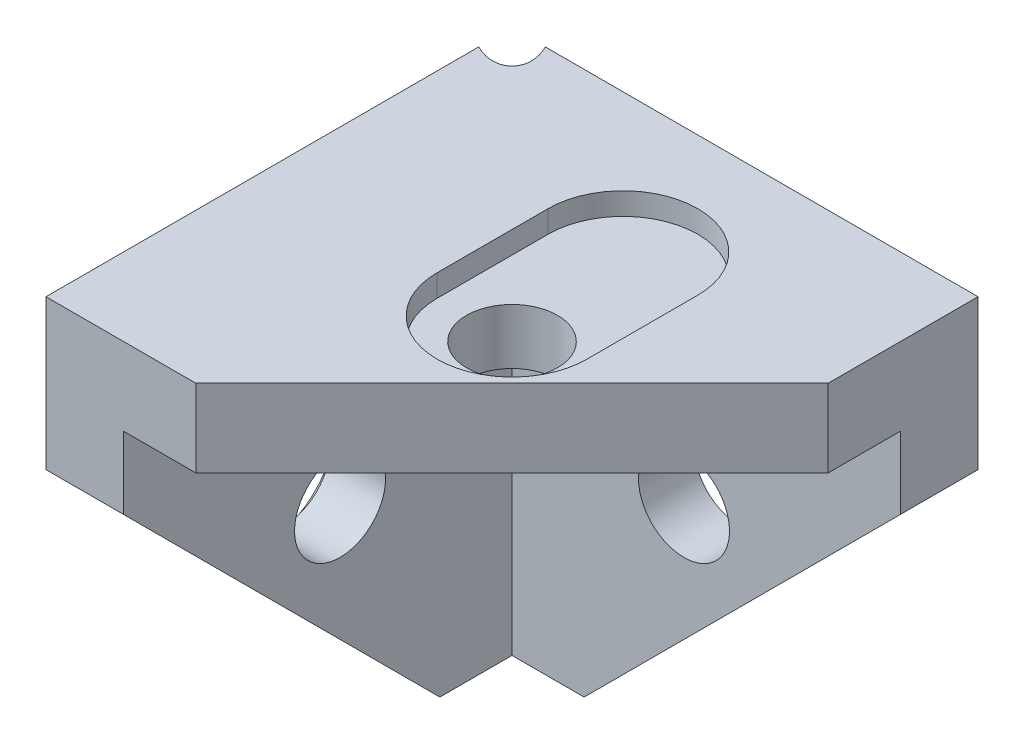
ISO-10303-21;
HEADER;
FILE_DESCRIPTION(('STEP AP214'),'2;1');
FILE_NAME('part.step','',(''),(''),'','','');
FILE_SCHEMA(('AUTOMOTIVE_DESIGN { 1 0 10303 214 1 1 1 1 }'));
ENDSEC;
DATA;
#1=APPLICATION_CONTEXT('core data for automotive mechanical design processes');
#2=APPLICATION_PROTOCOL_DEFINITION('international standard','automotive_design',2000,#1);
#3=PRODUCT_CONTEXT('',#1,'mechanical');
#4=PRODUCT('Part','Part','',(#3));
#5=PRODUCT_RELATED_PRODUCT_CATEGORY('part','',(#4));
#6=PRODUCT_DEFINITION_FORMATION('','',#4);
#7=PRODUCT_DEFINITION_CONTEXT('part definition',#1,'design');
#8=PRODUCT_DEFINITION('design','',#6,#7);
#9=PRODUCT_DEFINITION_SHAPE('','',#8);
#10=(LENGTH_UNIT() NAMED_UNIT(*) SI_UNIT(.MILLI.,.METRE.));
#11=(NAMED_UNIT(*) PLANE_ANGLE_UNIT() SI_UNIT($,.RADIAN.));
#12=(NAMED_UNIT(*) SI_UNIT($,.STERADIAN.) SOLID_ANGLE_UNIT());
#13=UNCERTAINTY_MEASURE_WITH_UNIT(LENGTH_MEASURE(1.E-05),#10,'distance_accuracy_value','');
#14=(GEOMETRIC_REPRESENTATION_CONTEXT(3) GLOBAL_UNCERTAINTY_ASSIGNED_CONTEXT((#13)) GLOBAL_UNIT_ASSIGNED_CONTEXT((#10,
#11,#12)) REPRESENTATION_CONTEXT('',''));
#15=CARTESIAN_POINT('',(0.,0.,0.));
#16=DIRECTION('',(0.,0.,1.));
#17=DIRECTION('',(1.,0.,0.));
#18=AXIS2_PLACEMENT_3D('',#15,#16,#17);
#19=CARTESIAN_POINT('',(2.,-17.5,22.5));
#20=DIRECTION('',(1.,0.,0.));
#21=DIRECTION('',(0.,0.,-1.));
#22=AXIS2_PLACEMENT_3D('',#19,#20,#21);
#23=PLANE('',#22);
#24=CARTESIAN_POINT('',(2.,-22.5,22.5));
#25=DIRECTION('',(-1.,0.,0.));
#26=DIRECTION('',(0.,0.,1.));
#27=AXIS2_PLACEMENT_3D('',#24,#25,#26);
#28=CIRCLE('',#27,4.1);
#29=CARTESIAN_POINT('',(2.,-22.5,26.6));
#30=VERTEX_POINT('',#29);
#31=EDGE_CURVE('E365',#30,#30,#28,.F.);
#32=ORIENTED_EDGE('',*,*,#31,.T.);
#33=EDGE_LOOP('',(#32));
#34=FACE_BOUND('',#33,.T.);
#35=DIRECTION('',(0.,1.,0.));
#36=VECTOR('',#35,1.);
#37=CARTESIAN_POINT('',(2.,-12.5,15.75));
#38=LINE('',#37,#36);
#39=CARTESIAN_POINT('',(2.,-12.5,15.75));
#40=VERTEX_POINT('',#39);
#41=CARTESIAN_POINT('',(2.,-22.5,15.75));
#42=VERTEX_POINT('',#41);
#43=EDGE_CURVE('E291',#40,#42,#38,.F.);
#44=ORIENTED_EDGE('',*,*,#43,.T.);
#45=CARTESIAN_POINT('',(2.,-22.5,22.5));
#46=DIRECTION('',(1.,0.,0.));
#47=DIRECTION('',(0.,0.,-1.));
#48=AXIS2_PLACEMENT_3D('',#45,#46,#47);
#49=CIRCLE('',#48,6.75);
#50=CARTESIAN_POINT('',(2.,-22.5,29.25));
#51=VERTEX_POINT('',#50);
#52=EDGE_CURVE('E288',#42,#51,#49,.F.);
#53=ORIENTED_EDGE('',*,*,#52,.T.);
#54=DIRECTION('',(0.,1.,0.));
#55=VECTOR('',#54,1.);
#56=CARTESIAN_POINT('',(2.,-22.5,29.25));
#57=LINE('',#56,#55);
#58=CARTESIAN_POINT('',(2.,-12.5,29.25));
#59=VERTEX_POINT('',#58);
#60=EDGE_CURVE('E294',#51,#59,#57,.T.);
#61=ORIENTED_EDGE('',*,*,#60,.T.);
#62=CARTESIAN_POINT('',(2.,-12.5,22.5));
#63=DIRECTION('',(1.,0.,0.));
#64=DIRECTION('',(0.,0.,-1.));
#65=AXIS2_PLACEMENT_3D('',#62,#63,#64);
#66=CIRCLE('',#65,6.75);
#67=EDGE_CURVE('E297',#59,#40,#66,.F.);
#68=ORIENTED_EDGE('',*,*,#67,.T.);
#69=EDGE_LOOP('',(#44,#53,#61,#68));
#70=FACE_BOUND('',#69,.T.);
#71=ADVANCED_FACE('F36',(#34,#70),#23,.F.);
#72=CARTESIAN_POINT('',(7.,-22.5,22.5));
#73=DIRECTION('',(-1.,0.,0.));
#74=DIRECTION('',(0.,0.,1.));
#75=AXIS2_PLACEMENT_3D('',#72,#73,#74);
#76=CYLINDRICAL_SURFACE('',#75,4.1);
#77=CARTESIAN_POINT('',(7.,-22.5,22.5));
#78=DIRECTION('',(-1.,0.,0.));
#79=DIRECTION('',(0.,0.,1.));
#80=AXIS2_PLACEMENT_3D('',#77,#78,#79);
#81=CIRCLE('',#80,4.1);
#82=CARTESIAN_POINT('',(7.,-22.5,26.6));
#83=VERTEX_POINT('',#82);
#84=EDGE_CURVE('E282',#83,#83,#81,.F.);
#85=ORIENTED_EDGE('',*,*,#84,.T.);
#86=EDGE_LOOP('',(#85));
#87=FACE_BOUND('',#86,.T.);
#88=ORIENTED_EDGE('',*,*,#31,.F.);
#89=EDGE_LOOP('',(#88));
#90=FACE_BOUND('',#89,.T.);
#91=ADVANCED_FACE('F541',(#87,#90),#76,.F.);
#92=CARTESIAN_POINT('',(22.5,-22.5,7.00000000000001));
#93=DIRECTION('',(0.,0.,-1.));
#94=DIRECTION('',(-1.,0.,0.));
#95=AXIS2_PLACEMENT_3D('',#92,#93,#94);
#96=CYLINDRICAL_SURFACE('',#95,4.1);
#97=CARTESIAN_POINT('',(22.5,-22.5,7.00000000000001));
#98=DIRECTION('',(0.,0.,-1.));
#99=DIRECTION('',(-1.,0.,0.));
#100=AXIS2_PLACEMENT_3D('',#97,#98,#99);
#101=CIRCLE('',#100,4.1);
#102=CARTESIAN_POINT('',(18.4,-22.5,7.00000000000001));
#103=VERTEX_POINT('',#102);
#104=EDGE_CURVE('E272',#103,#103,#101,.T.);
#105=ORIENTED_EDGE('',*,*,#104,.F.);
#106=EDGE_LOOP('',(#105));
#107=FACE_BOUND('',#106,.T.);
#108=CARTESIAN_POINT('',(22.5,-22.5,2.));
#109=DIRECTION('',(0.,0.,-1.));
#110=DIRECTION('',(-1.,0.,0.));
#111=AXIS2_PLACEMENT_3D('',#108,#109,#110);
#112=CIRCLE('',#111,4.1);
#113=CARTESIAN_POINT('',(18.4,-22.5,2.));
#114=VERTEX_POINT('',#113);
#115=EDGE_CURVE('E363',#114,#114,#112,.T.);
#116=ORIENTED_EDGE('',*,*,#115,.T.);
#117=EDGE_LOOP('',(#116));
#118=FACE_BOUND('',#117,.T.);
#119=ADVANCED_FACE('F537',(#107,#118),#96,.F.);
#120=CARTESIAN_POINT('',(17.4999797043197,-22.4882973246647,2.));
#121=DIRECTION('',(0.,0.,1.));
#122=DIRECTION('',(1.,0.,0.));
#123=AXIS2_PLACEMENT_3D('',#120,#121,#122);
#124=PLANE('',#123);
#125=ORIENTED_EDGE('',*,*,#115,.F.);
#126=EDGE_LOOP('',(#125));
#127=FACE_BOUND('',#126,.T.);
#128=CARTESIAN_POINT('',(12.499959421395,-22.4765946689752,2.));
#129=DIRECTION('',(0.,0.,1.));
#130=DIRECTION('',(1.,0.,0.));
#131=AXIS2_PLACEMENT_3D('',#128,#129,#130);
#132=CIRCLE('',#131,6.75);
#133=CARTESIAN_POINT('',(12.484160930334,-29.2265761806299,2.));
#134=VERTEX_POINT('',#133);
#135=CARTESIAN_POINT('',(12.5157579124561,-15.7266131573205,2.));
#136=VERTEX_POINT('',#135);
#137=EDGE_CURVE('E256',#134,#136,#132,.F.);
#138=ORIENTED_EDGE('',*,*,#137,.T.);
#139=DIRECTION('',(-0.999997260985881,0.002340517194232,0.));
#140=VECTOR('',#139,1.);
#141=CARTESIAN_POINT('',(12.5157579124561,-15.7266131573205,2.));
#142=LINE('',#141,#140);
#143=CARTESIAN_POINT('',(22.5157984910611,-15.7500184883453,2.));
#144=VERTEX_POINT('',#143);
#145=EDGE_CURVE('E252',#136,#144,#142,.F.);
#146=ORIENTED_EDGE('',*,*,#145,.T.);
#147=CARTESIAN_POINT('',(22.5,-22.5,2.));
#148=DIRECTION('',(0.,0.,1.));
#149=DIRECTION('',(1.,0.,0.));
#150=AXIS2_PLACEMENT_3D('',#147,#148,#149);
#151=CIRCLE('',#150,6.75);
#152=CARTESIAN_POINT('',(22.4842015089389,-29.2499815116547,2.));
#153=VERTEX_POINT('',#152);
#154=EDGE_CURVE('E248',#144,#153,#151,.F.);
#155=ORIENTED_EDGE('',*,*,#154,.T.);
#156=DIRECTION('',(0.999997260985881,-0.002340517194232,0.));
#157=VECTOR('',#156,1.);
#158=CARTESIAN_POINT('',(22.4842015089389,-29.2499815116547,2.));
#159=LINE('',#158,#157);
#160=EDGE_CURVE('E245',#153,#134,#159,.F.);
#161=ORIENTED_EDGE('',*,*,#160,.T.);
#162=EDGE_LOOP('',(#138,#146,#155,#161));
#163=FACE_BOUND('',#162,.T.);
#164=ADVANCED_FACE('F534',(#127,#163),#124,.F.);
#165=CARTESIAN_POINT('',(22.5,-7.,22.5));
#166=DIRECTION('',(0.,1.,0.));
#167=DIRECTION('',(0.,0.,1.));
#168=AXIS2_PLACEMENT_3D('',#165,#166,#167);
#169=CYLINDRICAL_SURFACE('',#168,4.1);
#170=CARTESIAN_POINT('',(22.5,-6.99999999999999,22.5));
#171=DIRECTION('',(0.,1.,0.));
#172=DIRECTION('',(0.,0.,1.));
#173=AXIS2_PLACEMENT_3D('',#170,#171,#172);
#174=CIRCLE('',#173,4.1);
#175=CARTESIAN_POINT('',(22.5,-6.99999999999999,26.6));
#176=VERTEX_POINT('',#175);
#177=EDGE_CURVE('E277',#176,#176,#174,.F.);
#178=ORIENTED_EDGE('',*,*,#177,.T.);
#179=EDGE_LOOP('',(#178));
#180=FACE_BOUND('',#179,.T.);
#181=CARTESIAN_POINT('',(22.5,-1.99999999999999,22.5));
#182=DIRECTION('',(0.,1.,0.));
#183=DIRECTION('',(0.,0.,1.));
#184=AXIS2_PLACEMENT_3D('',#181,#182,#183);
#185=CIRCLE('',#184,4.1);
#186=CARTESIAN_POINT('',(22.5,-1.99999999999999,26.6));
#187=VERTEX_POINT('',#186);
#188=EDGE_CURVE('E300',#187,#187,#185,.F.);
#189=ORIENTED_EDGE('',*,*,#188,.F.);
#190=EDGE_LOOP('',(#189));
#191=FACE_BOUND('',#190,.T.);
#192=ADVANCED_FACE('F38',(#180,#191),#169,.F.);
#193=CARTESIAN_POINT('',(0.,-12.5,22.5));
#194=DIRECTION('',(1.,0.,0.));
#195=DIRECTION('',(0.,0.,-1.));
#196=AXIS2_PLACEMENT_3D('',#193,#194,#195);
#197=CYLINDRICAL_SURFACE('',#196,6.75);
#198=DIRECTION('',(1.,0.,0.));
#199=VECTOR('',#198,1.);
#200=CARTESIAN_POINT('',(0.,-12.5,29.25));
#201=LINE('',#200,#199);
#202=CARTESIAN_POINT('',(0.,-12.5,29.25));
#203=VERTEX_POINT('',#202);
#204=EDGE_CURVE('E295',#59,#203,#201,.F.);
#205=ORIENTED_EDGE('',*,*,#204,.T.);
#206=CARTESIAN_POINT('',(0.,-12.5,22.5));
#207=DIRECTION('',(1.,0.,0.));
#208=DIRECTION('',(0.,0.,-1.));
#209=AXIS2_PLACEMENT_3D('',#206,#207,#208);
#210=CIRCLE('',#209,6.75);
#211=CARTESIAN_POINT('',(0.,-12.5,15.75));
#212=VERTEX_POINT('',#211);
#213=EDGE_CURVE('E231',#212,#203,#210,.T.);
#214=ORIENTED_EDGE('',*,*,#213,.F.);
#215=DIRECTION('',(-1.,0.,0.));
#216=VECTOR('',#215,1.);
#217=CARTESIAN_POINT('',(0.,-12.5,15.75));
#218=LINE('',#217,#216);
#219=EDGE_CURVE('E287',#212,#40,#218,.F.);
#220=ORIENTED_EDGE('',*,*,#219,.T.);
#221=ORIENTED_EDGE('',*,*,#67,.F.);
#222=EDGE_LOOP('',(#205,#214,#220,#221));
#223=FACE_BOUND('',#222,.T.);
#224=ADVANCED_FACE('F529',(#223),#197,.F.);
#225=CARTESIAN_POINT('',(0.,-22.5,29.25));
#226=DIRECTION('',(0.,0.,1.));
#227=DIRECTION('',(1.,0.,0.));
#228=AXIS2_PLACEMENT_3D('',#225,#226,#227);
#229=PLANE('',#228);
#230=DIRECTION('',(1.,0.,0.));
#231=VECTOR('',#230,1.);
#232=CARTESIAN_POINT('',(0.,-22.5,29.25));
#233=LINE('',#232,#231);
#234=CARTESIAN_POINT('',(0.,-22.5,29.25));
#235=VERTEX_POINT('',#234);
#236=EDGE_CURVE('E292',#51,#235,#233,.F.);
#237=ORIENTED_EDGE('',*,*,#236,.T.);
#238=DIRECTION('',(0.,1.,0.));
#239=VECTOR('',#238,1.);
#240=CARTESIAN_POINT('',(0.,-42.,29.25));
#241=LINE('',#240,#239);
#242=EDGE_CURVE('E228',#203,#235,#241,.F.);
#243=ORIENTED_EDGE('',*,*,#242,.F.);
#244=ORIENTED_EDGE('',*,*,#204,.F.);
#245=ORIENTED_EDGE('',*,*,#60,.F.);
#246=EDGE_LOOP('',(#237,#243,#244,#245));
#247=FACE_BOUND('',#246,.T.);
#248=ADVANCED_FACE('F525',(#247),#229,.F.);
#249=CARTESIAN_POINT('',(0.,-22.5,22.5));
#250=DIRECTION('',(1.,0.,0.));
#251=DIRECTION('',(0.,0.,-1.));
#252=AXIS2_PLACEMENT_3D('',#249,#250,#251);
#253=CYLINDRICAL_SURFACE('',#252,6.75);
#254=DIRECTION('',(-1.,0.,0.));
#255=VECTOR('',#254,1.);
#256=CARTESIAN_POINT('',(0.,-22.5,15.75));
#257=LINE('',#256,#255);
#258=CARTESIAN_POINT('',(0.,-22.5,15.75));
#259=VERTEX_POINT('',#258);
#260=EDGE_CURVE('E285',#42,#259,#257,.T.);
#261=ORIENTED_EDGE('',*,*,#260,.T.);
#262=CARTESIAN_POINT('',(0.,-22.5,22.5));
#263=DIRECTION('',(1.,0.,0.));
#264=DIRECTION('',(0.,0.,-1.));
#265=AXIS2_PLACEMENT_3D('',#262,#263,#264);
#266=CIRCLE('',#265,6.75);
#267=EDGE_CURVE('E223',#235,#259,#266,.T.);
#268=ORIENTED_EDGE('',*,*,#267,.F.);
#269=ORIENTED_EDGE('',*,*,#236,.F.);
#270=ORIENTED_EDGE('',*,*,#52,.F.);
#271=EDGE_LOOP('',(#261,#268,#269,#270));
#272=FACE_BOUND('',#271,.T.);
#273=ADVANCED_FACE('F521',(#272),#253,.F.);
#274=CARTESIAN_POINT('',(0.,-12.5,15.75));
#275=DIRECTION('',(0.,0.,-1.));
#276=DIRECTION('',(-1.,0.,0.));
#277=AXIS2_PLACEMENT_3D('',#274,#275,#276);
#278=PLANE('',#277);
#279=ORIENTED_EDGE('',*,*,#219,.F.);
#280=DIRECTION('',(0.,1.,0.));
#281=VECTOR('',#280,1.);
#282=CARTESIAN_POINT('',(0.,-42.,15.75));
#283=LINE('',#282,#281);
#284=EDGE_CURVE('E218',#259,#212,#283,.T.);
#285=ORIENTED_EDGE('',*,*,#284,.F.);
#286=ORIENTED_EDGE('',*,*,#260,.F.);
#287=ORIENTED_EDGE('',*,*,#43,.F.);
#288=EDGE_LOOP('',(#279,#285,#286,#287));
#289=FACE_BOUND('',#288,.T.);
#290=ADVANCED_FACE('F517',(#289),#278,.F.);
#291=CARTESIAN_POINT('',(7.,-6.99999999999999,42.));
#292=DIRECTION('',(-1.,0.,0.));
#293=DIRECTION('',(0.,0.,1.));
#294=AXIS2_PLACEMENT_3D('',#291,#292,#293);
#295=PLANE('',#294);
#296=ORIENTED_EDGE('',*,*,#84,.F.);
#297=EDGE_LOOP('',(#296));
#298=FACE_BOUND('',#297,.T.);
#299=DIRECTION('',(0.,1.,0.));
#300=VECTOR('',#299,1.);
#301=CARTESIAN_POINT('',(7.,-17.6568542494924,42.));
#302=LINE('',#301,#300);
#303=CARTESIAN_POINT('',(7.,-13.5,42.));
#304=VERTEX_POINT('',#303);
#305=CARTESIAN_POINT('',(7.,-6.99999999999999,42.));
#306=VERTEX_POINT('',#305);
#307=EDGE_CURVE('E217',#304,#306,#302,.T.);
#308=ORIENTED_EDGE('',*,*,#307,.F.);
#309=DIRECTION('',(0.,-0.707106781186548,-0.707106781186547));
#310=VECTOR('',#309,1.);
#311=CARTESIAN_POINT('',(7.,-10.25,45.25));
#312=LINE('',#311,#310);
#313=CARTESIAN_POINT('',(7.,-42.,13.5));
#314=VERTEX_POINT('',#313);
#315=EDGE_CURVE('E50',#304,#314,#312,.T.);
#316=ORIENTED_EDGE('',*,*,#315,.T.);
#317=DIRECTION('',(0.,0.,-1.));
#318=VECTOR('',#317,1.);
#319=CARTESIAN_POINT('',(7.00000000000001,-42.,0.));
#320=LINE('',#319,#318);
#321=CARTESIAN_POINT('',(7.,-42.,7.00000000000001));
#322=VERTEX_POINT('',#321);
#323=EDGE_CURVE('E304',#322,#314,#320,.F.);
#324=ORIENTED_EDGE('',*,*,#323,.F.);
#325=DIRECTION('',(0.,1.,0.));
#326=VECTOR('',#325,1.);
#327=CARTESIAN_POINT('',(7.,-28.9551446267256,7.00000000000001));
#328=LINE('',#327,#326);
#329=CARTESIAN_POINT('',(7.,-10.0006249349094,7.00000000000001));
#330=VERTEX_POINT('',#329);
#331=EDGE_CURVE('E273',#330,#322,#328,.F.);
#332=ORIENTED_EDGE('',*,*,#331,.F.);
#333=CARTESIAN_POINT('',(7.,-7.,7.));
#334=DIRECTION('',(-1.,0.,0.));
#335=DIRECTION('',(0.,0.707106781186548,-0.707106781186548));
#336=AXIS2_PLACEMENT_3D('',#333,#334,#335);
#337=ELLIPSE('',#336,4.24352447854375,2.45);
#338=CARTESIAN_POINT('',(7.,-6.99999999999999,10.0006249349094));
#339=VERTEX_POINT('',#338);
#340=EDGE_CURVE('E345',#330,#339,#337,.T.);
#341=ORIENTED_EDGE('',*,*,#340,.T.);
#342=DIRECTION('',(0.,0.,1.));
#343=VECTOR('',#342,1.);
#344=CARTESIAN_POINT('',(7.,-6.99999999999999,42.));
#345=LINE('',#344,#343);
#346=EDGE_CURVE('E279',#339,#306,#345,.T.);
#347=ORIENTED_EDGE('',*,*,#346,.T.);
#348=EDGE_LOOP('',(#308,#316,#324,#332,#341,#347));
#349=FACE_BOUND('',#348,.T.);
#350=ADVANCED_FACE('F513',(#298,#349),#295,.F.);
#351=CARTESIAN_POINT('',(57.2448854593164,-6.99999999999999,42.));
#352=DIRECTION('',(0.,1.,0.));
#353=DIRECTION('',(0.,0.,1.));
#354=AXIS2_PLACEMENT_3D('',#351,#352,#353);
#355=PLANE('',#354);
#356=ORIENTED_EDGE('',*,*,#177,.F.);
#357=EDGE_LOOP('',(#356));
#358=FACE_BOUND('',#357,.T.);
#359=DIRECTION('',(0.,0.,-1.));
#360=VECTOR('',#359,1.);
#361=CARTESIAN_POINT('',(42.,-6.99999999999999,0.));
#362=LINE('',#361,#360);
#363=CARTESIAN_POINT('',(42.,-6.99999999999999,13.5));
#364=VERTEX_POINT('',#363);
#365=CARTESIAN_POINT('',(42.,-6.99999999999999,7.00000000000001));
#366=VERTEX_POINT('',#365);
#367=EDGE_CURVE('E269',#364,#366,#362,.T.);
#368=ORIENTED_EDGE('',*,*,#367,.F.);
#369=DIRECTION('',(-0.707106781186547,0.,0.707106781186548));
#370=VECTOR('',#369,1.);
#371=CARTESIAN_POINT('',(35.3724427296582,-6.99999999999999,20.1275572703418));
#372=LINE('',#371,#370);
#373=CARTESIAN_POINT('',(13.5,-6.99999999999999,42.));
#374=VERTEX_POINT('',#373);
#375=EDGE_CURVE('E367',#364,#374,#372,.T.);
#376=ORIENTED_EDGE('',*,*,#375,.T.);
#377=DIRECTION('',(1.,0.,0.));
#378=VECTOR('',#377,1.);
#379=CARTESIAN_POINT('',(17.6568542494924,-6.99999999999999,42.));
#380=LINE('',#379,#378);
#381=EDGE_CURVE('E220',#306,#374,#380,.T.);
#382=ORIENTED_EDGE('',*,*,#381,.F.);
#383=ORIENTED_EDGE('',*,*,#346,.F.);
#384=CARTESIAN_POINT('',(6.99999999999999,-6.99999999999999,6.99999999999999));
#385=DIRECTION('',(0.,1.,0.));
#386=DIRECTION('',(-0.707106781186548,0.,-0.707106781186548));
#387=AXIS2_PLACEMENT_3D('',#384,#385,#386);
#388=ELLIPSE('',#387,4.24352447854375,2.45);
#389=CARTESIAN_POINT('',(10.0006249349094,-6.99999999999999,7.00000000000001));
#390=VERTEX_POINT('',#389);
#391=EDGE_CURVE('E342',#339,#390,#388,.T.);
#392=ORIENTED_EDGE('',*,*,#391,.T.);
#393=DIRECTION('',(1.,0.,0.));
#394=VECTOR('',#393,1.);
#395=CARTESIAN_POINT('',(32.1224427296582,-6.99999999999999,7.00000000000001));
#396=LINE('',#395,#394);
#397=EDGE_CURVE('E270',#366,#390,#396,.F.);
#398=ORIENTED_EDGE('',*,*,#397,.F.);
#399=EDGE_LOOP('',(#368,#376,#382,#383,#392,#398));
#400=FACE_BOUND('',#399,.T.);
#401=ADVANCED_FACE('F437',(#358,#400),#355,.F.);
#402=CARTESIAN_POINT('',(32.1224427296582,-28.9551446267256,7.00000000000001));
#403=DIRECTION('',(0.,0.,1.));
#404=DIRECTION('',(1.,0.,0.));
#405=AXIS2_PLACEMENT_3D('',#402,#403,#404);
#406=PLANE('',#405);
#407=DIRECTION('',(-0.707106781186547,-0.707106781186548,0.));
#408=VECTOR('',#407,1.);
#409=CARTESIAN_POINT('',(29.3336490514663,-26.1663509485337,7.00000000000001));
#410=LINE('',#409,#408);
#411=CARTESIAN_POINT('',(42.,-13.5,7.00000000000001));
#412=VERTEX_POINT('',#411);
#413=CARTESIAN_POINT('',(13.5,-42.,7.00000000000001));
#414=VERTEX_POINT('',#413);
#415=EDGE_CURVE('E428',#412,#414,#410,.T.);
#416=ORIENTED_EDGE('',*,*,#415,.F.);
#417=DIRECTION('',(0.,1.,0.));
#418=VECTOR('',#417,1.);
#419=CARTESIAN_POINT('',(42.,0.,7.));
#420=LINE('',#419,#418);
#421=EDGE_CURVE('E266',#366,#412,#420,.F.);
#422=ORIENTED_EDGE('',*,*,#421,.F.);
#423=ORIENTED_EDGE('',*,*,#397,.T.);
#424=CARTESIAN_POINT('',(7.00000000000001,-7.00000000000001,7.00000000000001));
#425=DIRECTION('',(0.,0.,1.));
#426=DIRECTION('',(-0.707106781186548,0.707106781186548,0.));
#427=AXIS2_PLACEMENT_3D('',#424,#425,#426);
#428=ELLIPSE('',#427,4.24352447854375,2.45);
#429=EDGE_CURVE('E347',#390,#330,#428,.F.);
#430=ORIENTED_EDGE('',*,*,#429,.T.);
#431=ORIENTED_EDGE('',*,*,#331,.T.);
#432=DIRECTION('',(1.,0.,0.));
#433=VECTOR('',#432,1.);
#434=CARTESIAN_POINT('',(14.,-42.,7.00000000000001));
#435=LINE('',#434,#433);
#436=EDGE_CURVE('E302',#414,#322,#435,.F.);
#437=ORIENTED_EDGE('',*,*,#436,.F.);
#438=EDGE_LOOP('',(#416,#422,#423,#430,#431,#437));
#439=FACE_BOUND('',#438,.T.);
#440=ORIENTED_EDGE('',*,*,#104,.T.);
#441=EDGE_LOOP('',(#440));
#442=FACE_BOUND('',#441,.T.);
#443=ADVANCED_FACE('F444',(#439,#442),#406,.T.);
#444=CARTESIAN_POINT('',(14.,-42.,0.));
#445=DIRECTION('',(0.,-1.,0.));
#446=DIRECTION('',(0.,0.,-1.));
#447=AXIS2_PLACEMENT_3D('',#444,#445,#446);
#448=PLANE('',#447);
#449=DIRECTION('',(-1.,0.,0.));
#450=VECTOR('',#449,1.);
#451=CARTESIAN_POINT('',(10.,-42.,13.5));
#452=LINE('',#451,#450);
#453=CARTESIAN_POINT('',(0.,-42.,13.5));
#454=VERTEX_POINT('',#453);
#455=EDGE_CURVE('E210',#314,#454,#452,.T.);
#456=ORIENTED_EDGE('',*,*,#455,.T.);
#457=DIRECTION('',(0.,0.,1.));
#458=VECTOR('',#457,1.);
#459=CARTESIAN_POINT('',(0.,-42.,0.));
#460=LINE('',#459,#458);
#461=CARTESIAN_POINT('',(0.,-42.,0.));
#462=VERTEX_POINT('',#461);
#463=EDGE_CURVE('E209',#462,#454,#460,.T.);
#464=ORIENTED_EDGE('',*,*,#463,.F.);
#465=DIRECTION('',(1.,0.,0.));
#466=VECTOR('',#465,1.);
#467=CARTESIAN_POINT('',(17.6568542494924,-42.,0.));
#468=LINE('',#467,#466);
#469=CARTESIAN_POINT('',(13.5,-42.,0.));
#470=VERTEX_POINT('',#469);
#471=EDGE_CURVE('E257',#462,#470,#468,.T.);
#472=ORIENTED_EDGE('',*,*,#471,.T.);
#473=DIRECTION('',(0.,0.,-1.));
#474=VECTOR('',#473,1.);
#475=CARTESIAN_POINT('',(13.5,-42.,10.));
#476=LINE('',#475,#474);
#477=EDGE_CURVE('E58',#414,#470,#476,.T.);
#478=ORIENTED_EDGE('',*,*,#477,.F.);
#479=ORIENTED_EDGE('',*,*,#436,.T.);
#480=ORIENTED_EDGE('',*,*,#323,.T.);
#481=EDGE_LOOP('',(#456,#464,#472,#478,#479,#480));
#482=FACE_BOUND('',#481,.T.);
#483=ADVANCED_FACE('F418',(#482),#448,.T.);
#484=CARTESIAN_POINT('',(12.499959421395,-22.4765946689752,0.));
#485=DIRECTION('',(0.,0.,1.));
#486=DIRECTION('',(1.,0.,0.));
#487=AXIS2_PLACEMENT_3D('',#484,#485,#486);
#488=CYLINDRICAL_SURFACE('',#487,6.75);
#489=DIRECTION('',(0.,0.,1.));
#490=VECTOR('',#489,1.);
#491=CARTESIAN_POINT('',(12.484160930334,-29.2265761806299,0.));
#492=LINE('',#491,#490);
#493=CARTESIAN_POINT('',(12.484160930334,-29.2265761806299,0.));
#494=VERTEX_POINT('',#493);
#495=EDGE_CURVE('E246',#134,#494,#492,.F.);
#496=ORIENTED_EDGE('',*,*,#495,.T.);
#497=CARTESIAN_POINT('',(12.499959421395,-22.4765946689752,0.));
#498=DIRECTION('',(0.,0.,1.));
#499=DIRECTION('',(1.,0.,0.));
#500=AXIS2_PLACEMENT_3D('',#497,#498,#499);
#501=CIRCLE('',#500,6.75);
#502=CARTESIAN_POINT('',(12.5157579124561,-15.7266131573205,0.));
#503=VERTEX_POINT('',#502);
#504=EDGE_CURVE('E332',#494,#503,#501,.F.);
#505=ORIENTED_EDGE('',*,*,#504,.T.);
#506=DIRECTION('',(0.,0.,1.));
#507=VECTOR('',#506,1.);
#508=CARTESIAN_POINT('',(12.5157579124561,-15.7266131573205,0.));
#509=LINE('',#508,#507);
#510=EDGE_CURVE('E253',#503,#136,#509,.T.);
#511=ORIENTED_EDGE('',*,*,#510,.T.);
#512=ORIENTED_EDGE('',*,*,#137,.F.);
#513=EDGE_LOOP('',(#496,#505,#511,#512));
#514=FACE_BOUND('',#513,.T.);
#515=ADVANCED_FACE('F502',(#514),#488,.F.);
#516=CARTESIAN_POINT('',(12.5157579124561,-15.7266131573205,0.));
#517=DIRECTION('',(0.002340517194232,0.999997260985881,0.));
#518=DIRECTION('',(-0.999997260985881,0.002340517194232,0.));
#519=AXIS2_PLACEMENT_3D('',#516,#517,#518);
#520=PLANE('',#519);
#521=ORIENTED_EDGE('',*,*,#510,.F.);
#522=DIRECTION('',(0.999997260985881,-0.00234051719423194,0.));
#523=VECTOR('',#522,1.);
#524=CARTESIAN_POINT('',(12.5157579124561,-15.7266131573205,0.));
#525=LINE('',#524,#523);
#526=CARTESIAN_POINT('',(22.5157984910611,-15.7500184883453,0.));
#527=VERTEX_POINT('',#526);
#528=EDGE_CURVE('E331',#503,#527,#525,.T.);
#529=ORIENTED_EDGE('',*,*,#528,.T.);
#530=DIRECTION('',(0.,0.,1.));
#531=VECTOR('',#530,1.);
#532=CARTESIAN_POINT('',(22.5157984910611,-15.7500184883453,0.));
#533=LINE('',#532,#531);
#534=EDGE_CURVE('E249',#527,#144,#533,.T.);
#535=ORIENTED_EDGE('',*,*,#534,.T.);
#536=ORIENTED_EDGE('',*,*,#145,.F.);
#537=EDGE_LOOP('',(#521,#529,#535,#536));
#538=FACE_BOUND('',#537,.T.);
#539=ADVANCED_FACE('F498',(#538),#520,.F.);
#540=CARTESIAN_POINT('',(22.5,-22.5,0.));
#541=DIRECTION('',(0.,0.,1.));
#542=DIRECTION('',(1.,0.,0.));
#543=AXIS2_PLACEMENT_3D('',#540,#541,#542);
#544=CYLINDRICAL_SURFACE('',#543,6.75);
#545=ORIENTED_EDGE('',*,*,#534,.F.);
#546=CARTESIAN_POINT('',(22.5,-22.5,0.));
#547=DIRECTION('',(0.,0.,1.));
#548=DIRECTION('',(1.,0.,0.));
#549=AXIS2_PLACEMENT_3D('',#546,#547,#548);
#550=CIRCLE('',#549,6.75);
#551=CARTESIAN_POINT('',(22.4842015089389,-29.2499815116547,0.));
#552=VERTEX_POINT('',#551);
#553=EDGE_CURVE('E329',#527,#552,#550,.F.);
#554=ORIENTED_EDGE('',*,*,#553,.T.);
#555=DIRECTION('',(0.,0.,1.));
#556=VECTOR('',#555,1.);
#557=CARTESIAN_POINT('',(22.4842015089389,-29.2499815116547,0.));
#558=LINE('',#557,#556);
#559=EDGE_CURVE('E242',#552,#153,#558,.T.);
#560=ORIENTED_EDGE('',*,*,#559,.T.);
#561=ORIENTED_EDGE('',*,*,#154,.F.);
#562=EDGE_LOOP('',(#545,#554,#560,#561));
#563=FACE_BOUND('',#562,.T.);
#564=ADVANCED_FACE('F494',(#563),#544,.F.);
#565=CARTESIAN_POINT('',(22.4842015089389,-29.2499815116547,0.));
#566=DIRECTION('',(-0.002340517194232,-0.999997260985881,0.));
#567=DIRECTION('',(0.999997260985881,-0.002340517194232,0.));
#568=AXIS2_PLACEMENT_3D('',#565,#566,#567);
#569=PLANE('',#568);
#570=ORIENTED_EDGE('',*,*,#559,.F.);
#571=DIRECTION('',(-0.999997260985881,0.00234051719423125,0.));
#572=VECTOR('',#571,1.);
#573=CARTESIAN_POINT('',(22.4842015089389,-29.2499815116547,0.));
#574=LINE('',#573,#572);
#575=EDGE_CURVE('E328',#552,#494,#574,.T.);
#576=ORIENTED_EDGE('',*,*,#575,.T.);
#577=ORIENTED_EDGE('',*,*,#495,.F.);
#578=ORIENTED_EDGE('',*,*,#160,.F.);
#579=EDGE_LOOP('',(#570,#576,#577,#578));
#580=FACE_BOUND('',#579,.T.);
#581=ADVANCED_FACE('F490',(#580),#569,.F.);
#582=CARTESIAN_POINT('',(22.5,-1.99999999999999,17.5));
#583=DIRECTION('',(0.,1.,0.));
#584=DIRECTION('',(0.,0.,1.));
#585=AXIS2_PLACEMENT_3D('',#582,#583,#584);
#586=PLANE('',#585);
#587=ORIENTED_EDGE('',*,*,#188,.T.);
#588=EDGE_LOOP('',(#587));
#589=FACE_BOUND('',#588,.T.);
#590=CARTESIAN_POINT('',(22.5,-1.99999999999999,22.5));
#591=DIRECTION('',(0.,-1.,0.));
#592=DIRECTION('',(0.,0.,-1.));
#593=AXIS2_PLACEMENT_3D('',#590,#591,#592);
#594=CIRCLE('',#593,6.75);
#595=CARTESIAN_POINT('',(15.75,-1.99999999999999,22.5));
#596=VERTEX_POINT('',#595);
#597=CARTESIAN_POINT('',(29.25,-1.99999999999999,22.5));
#598=VERTEX_POINT('',#597);
#599=EDGE_CURVE('E322',#596,#598,#594,.F.);
#600=ORIENTED_EDGE('',*,*,#599,.T.);
#601=DIRECTION('',(0.,0.,-1.));
#602=VECTOR('',#601,1.);
#603=CARTESIAN_POINT('',(29.25,-1.99999999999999,22.5));
#604=LINE('',#603,#602);
#605=CARTESIAN_POINT('',(29.25,-1.99999999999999,12.5));
#606=VERTEX_POINT('',#605);
#607=EDGE_CURVE('E237',#598,#606,#604,.T.);
#608=ORIENTED_EDGE('',*,*,#607,.T.);
#609=CARTESIAN_POINT('',(22.5,-1.99999999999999,12.5));
#610=DIRECTION('',(0.,-1.,0.));
#611=DIRECTION('',(0.,0.,-1.));
#612=AXIS2_PLACEMENT_3D('',#609,#610,#611);
#613=CIRCLE('',#612,6.75);
#614=CARTESIAN_POINT('',(15.75,-1.99999999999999,12.5));
#615=VERTEX_POINT('',#614);
#616=EDGE_CURVE('E326',#606,#615,#613,.F.);
#617=ORIENTED_EDGE('',*,*,#616,.T.);
#618=DIRECTION('',(0.,0.,1.));
#619=VECTOR('',#618,1.);
#620=CARTESIAN_POINT('',(15.75,-1.99999999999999,12.5));
#621=LINE('',#620,#619);
#622=EDGE_CURVE('E232',#615,#596,#621,.T.);
#623=ORIENTED_EDGE('',*,*,#622,.T.);
#624=EDGE_LOOP('',(#600,#608,#617,#623));
#625=FACE_BOUND('',#624,.T.);
#626=ADVANCED_FACE('F487',(#589,#625),#586,.T.);
#627=CARTESIAN_POINT('',(14.,-14.,14.));
#628=DIRECTION('',(-0.577350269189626,0.577350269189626,-0.577350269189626));
#629=DIRECTION('',(-0.707106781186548,0.,0.707106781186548));
#630=AXIS2_PLACEMENT_3D('',#627,#628,#629);
#631=CYLINDRICAL_SURFACE('',#630,2.45);
#632=CARTESIAN_POINT('',(0.,0.,0.));
#633=DIRECTION('',(0.,1.,0.));
#634=DIRECTION('',(-0.707106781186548,0.,-0.707106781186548));
#635=AXIS2_PLACEMENT_3D('',#632,#633,#634);
#636=ELLIPSE('',#635,4.24352447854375,2.45);
#637=CARTESIAN_POINT('',(3.00062493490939,0.,0.));
#638=VERTEX_POINT('',#637);
#639=CARTESIAN_POINT('',(0.,0.,3.0006249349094));
#640=VERTEX_POINT('',#639);
#641=EDGE_CURVE('E235',#638,#640,#636,.F.);
#642=ORIENTED_EDGE('',*,*,#641,.F.);
#643=CARTESIAN_POINT('',(0.,0.,0.));
#644=DIRECTION('',(0.,0.,1.));
#645=DIRECTION('',(-0.707106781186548,0.707106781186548,0.));
#646=AXIS2_PLACEMENT_3D('',#643,#644,#645);
#647=ELLIPSE('',#646,4.24352447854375,2.45);
#648=CARTESIAN_POINT('',(0.,-3.0006249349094,0.));
#649=VERTEX_POINT('',#648);
#650=EDGE_CURVE('E334',#638,#649,#647,.F.);
#651=ORIENTED_EDGE('',*,*,#650,.T.);
#652=CARTESIAN_POINT('',(0.,0.,0.));
#653=DIRECTION('',(-1.,0.,0.));
#654=DIRECTION('',(0.,0.707106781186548,-0.707106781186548));
#655=AXIS2_PLACEMENT_3D('',#652,#653,#654);
#656=ELLIPSE('',#655,4.24352447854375,2.45);
#657=EDGE_CURVE('E265',#640,#649,#656,.F.);
#658=ORIENTED_EDGE('',*,*,#657,.F.);
#659=EDGE_LOOP('',(#642,#651,#658));
#660=FACE_BOUND('',#659,.T.);
#661=ORIENTED_EDGE('',*,*,#340,.F.);
#662=ORIENTED_EDGE('',*,*,#429,.F.);
#663=ORIENTED_EDGE('',*,*,#391,.F.);
#664=EDGE_LOOP('',(#661,#662,#663));
#665=FACE_BOUND('',#664,.T.);
#666=ADVANCED_FACE('F411',(#660,#665),#631,.F.);
#667=CARTESIAN_POINT('',(0.,-42.,0.));
#668=DIRECTION('',(-1.,0.,0.));
#669=DIRECTION('',(0.,0.,1.));
#670=AXIS2_PLACEMENT_3D('',#667,#668,#669);
#671=PLANE('',#670);
#672=DIRECTION('',(0.,-0.707106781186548,-0.707106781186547));
#673=VECTOR('',#672,1.);
#674=CARTESIAN_POINT('',(0.,-50.9207106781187,4.57928932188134));
#675=LINE('',#674,#673);
#676=CARTESIAN_POINT('',(0.,-13.5,42.));
#677=VERTEX_POINT('',#676);
#678=EDGE_CURVE('E196',#677,#454,#675,.T.);
#679=ORIENTED_EDGE('',*,*,#678,.F.);
#680=DIRECTION('',(0.,1.,0.));
#681=VECTOR('',#680,1.);
#682=CARTESIAN_POINT('',(0.,-17.6568542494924,42.));
#683=LINE('',#682,#681);
#684=CARTESIAN_POINT('',(0.,0.,42.));
#685=VERTEX_POINT('',#684);
#686=EDGE_CURVE('E206',#685,#677,#683,.F.);
#687=ORIENTED_EDGE('',*,*,#686,.F.);
#688=DIRECTION('',(0.,0.,1.));
#689=VECTOR('',#688,1.);
#690=CARTESIAN_POINT('',(0.,0.,0.));
#691=LINE('',#690,#689);
#692=EDGE_CURVE('E321',#640,#685,#691,.T.);
#693=ORIENTED_EDGE('',*,*,#692,.F.);
#694=ORIENTED_EDGE('',*,*,#657,.T.);
#695=DIRECTION('',(0.,1.,0.));
#696=VECTOR('',#695,1.);
#697=CARTESIAN_POINT('',(0.,-17.6568542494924,0.));
#698=LINE('',#697,#696);
#699=EDGE_CURVE('E262',#649,#462,#698,.F.);
#700=ORIENTED_EDGE('',*,*,#699,.T.);
#701=ORIENTED_EDGE('',*,*,#463,.T.);
#702=EDGE_LOOP('',(#679,#687,#693,#694,#700,#701));
#703=FACE_BOUND('',#702,.T.);
#704=ORIENTED_EDGE('',*,*,#267,.T.);
#705=ORIENTED_EDGE('',*,*,#284,.T.);
#706=ORIENTED_EDGE('',*,*,#213,.T.);
#707=ORIENTED_EDGE('',*,*,#242,.T.);
#708=EDGE_LOOP('',(#704,#705,#706,#707));
#709=FACE_BOUND('',#708,.T.);
#710=ADVANCED_FACE('F203',(#703,#709),#671,.T.);
#711=CARTESIAN_POINT('',(17.6568542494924,-17.6568542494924,42.));
#712=DIRECTION('',(0.,0.,1.));
#713=DIRECTION('',(1.,0.,0.));
#714=AXIS2_PLACEMENT_3D('',#711,#712,#713);
#715=PLANE('',#714);
#716=DIRECTION('',(-1.,0.,0.));
#717=VECTOR('',#716,1.);
#718=CARTESIAN_POINT('',(17.6568542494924,-13.5,42.));
#719=LINE('',#718,#717);
#720=EDGE_CURVE('E11',#304,#677,#719,.T.);
#721=ORIENTED_EDGE('',*,*,#720,.F.);
#722=ORIENTED_EDGE('',*,*,#307,.T.);
#723=ORIENTED_EDGE('',*,*,#381,.T.);
#724=DIRECTION('',(0.,1.,0.));
#725=VECTOR('',#724,1.);
#726=CARTESIAN_POINT('',(13.5,-10.,42.));
#727=LINE('',#726,#725);
#728=CARTESIAN_POINT('',(13.5,0.,42.));
#729=VERTEX_POINT('',#728);
#730=EDGE_CURVE('E372',#374,#729,#727,.T.);
#731=ORIENTED_EDGE('',*,*,#730,.T.);
#732=DIRECTION('',(1.,0.,0.));
#733=VECTOR('',#732,1.);
#734=CARTESIAN_POINT('',(0.,0.,42.));
#735=LINE('',#734,#733);
#736=EDGE_CURVE('E215',#685,#729,#735,.T.);
#737=ORIENTED_EDGE('',*,*,#736,.F.);
#738=ORIENTED_EDGE('',*,*,#686,.T.);
#739=EDGE_LOOP('',(#721,#722,#723,#731,#737,#738));
#740=FACE_BOUND('',#739,.T.);
#741=ADVANCED_FACE('F212',(#740),#715,.T.);
#742=CARTESIAN_POINT('',(42.,0.,0.));
#743=DIRECTION('',(1.,0.,0.));
#744=DIRECTION('',(0.,0.,-1.));
#745=AXIS2_PLACEMENT_3D('',#742,#743,#744);
#746=PLANE('',#745);
#747=DIRECTION('',(0.,0.,-1.));
#748=VECTOR('',#747,1.);
#749=CARTESIAN_POINT('',(42.,-13.5,10.));
#750=LINE('',#749,#748);
#751=CARTESIAN_POINT('',(42.,-13.5,0.));
#752=VERTEX_POINT('',#751);
#753=EDGE_CURVE('E425',#412,#752,#750,.T.);
#754=ORIENTED_EDGE('',*,*,#753,.T.);
#755=DIRECTION('',(0.,1.,0.));
#756=VECTOR('',#755,1.);
#757=CARTESIAN_POINT('',(42.,-17.6568542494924,0.));
#758=LINE('',#757,#756);
#759=CARTESIAN_POINT('',(42.,0.,0.));
#760=VERTEX_POINT('',#759);
#761=EDGE_CURVE('E261',#752,#760,#758,.T.);
#762=ORIENTED_EDGE('',*,*,#761,.T.);
#763=DIRECTION('',(0.,0.,1.));
#764=VECTOR('',#763,1.);
#765=CARTESIAN_POINT('',(42.,0.,0.));
#766=LINE('',#765,#764);
#767=CARTESIAN_POINT('',(42.,0.,13.5));
#768=VERTEX_POINT('',#767);
#769=EDGE_CURVE('E388',#768,#760,#766,.F.);
#770=ORIENTED_EDGE('',*,*,#769,.F.);
#771=DIRECTION('',(0.,1.,0.));
#772=VECTOR('',#771,1.);
#773=CARTESIAN_POINT('',(42.,-10.,13.5));
#774=LINE('',#773,#772);
#775=EDGE_CURVE('E378',#364,#768,#774,.T.);
#776=ORIENTED_EDGE('',*,*,#775,.F.);
#777=ORIENTED_EDGE('',*,*,#367,.T.);
#778=ORIENTED_EDGE('',*,*,#421,.T.);
#779=EDGE_LOOP('',(#754,#762,#770,#776,#777,#778));
#780=FACE_BOUND('',#779,.T.);
#781=ADVANCED_FACE('F435',(#780),#746,.T.);
#782=CARTESIAN_POINT('',(17.6568542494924,-17.6568542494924,0.));
#783=DIRECTION('',(0.,0.,1.));
#784=DIRECTION('',(1.,0.,0.));
#785=AXIS2_PLACEMENT_3D('',#782,#783,#784);
#786=PLANE('',#785);
#787=ORIENTED_EDGE('',*,*,#553,.F.);
#788=ORIENTED_EDGE('',*,*,#528,.F.);
#789=ORIENTED_EDGE('',*,*,#504,.F.);
#790=ORIENTED_EDGE('',*,*,#575,.F.);
#791=EDGE_LOOP('',(#787,#788,#789,#790));
#792=FACE_BOUND('',#791,.T.);
#793=ORIENTED_EDGE('',*,*,#761,.F.);
#794=DIRECTION('',(0.707106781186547,0.707106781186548,0.));
#795=VECTOR('',#794,1.);
#796=CARTESIAN_POINT('',(4.57928932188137,-50.9207106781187,0.));
#797=LINE('',#796,#795);
#798=EDGE_CURVE('E416',#470,#752,#797,.T.);
#799=ORIENTED_EDGE('',*,*,#798,.F.);
#800=ORIENTED_EDGE('',*,*,#471,.F.);
#801=ORIENTED_EDGE('',*,*,#699,.F.);
#802=ORIENTED_EDGE('',*,*,#650,.F.);
#803=DIRECTION('',(1.,0.,0.));
#804=VECTOR('',#803,1.);
#805=CARTESIAN_POINT('',(0.,0.,0.));
#806=LINE('',#805,#804);
#807=EDGE_CURVE('E318',#760,#638,#806,.F.);
#808=ORIENTED_EDGE('',*,*,#807,.F.);
#809=EDGE_LOOP('',(#793,#799,#800,#801,#802,#808));
#810=FACE_BOUND('',#809,.T.);
#811=ADVANCED_FACE('F415',(#792,#810),#786,.F.);
#812=CARTESIAN_POINT('',(22.5,0.,12.5));
#813=DIRECTION('',(0.,-1.,0.));
#814=DIRECTION('',(0.,0.,-1.));
#815=AXIS2_PLACEMENT_3D('',#812,#813,#814);
#816=CYLINDRICAL_SURFACE('',#815,6.75);
#817=DIRECTION('',(0.,1.,0.));
#818=VECTOR('',#817,1.);
#819=CARTESIAN_POINT('',(29.25,0.,12.5));
#820=LINE('',#819,#818);
#821=CARTESIAN_POINT('',(29.25,0.,12.5));
#822=VERTEX_POINT('',#821);
#823=EDGE_CURVE('E241',#606,#822,#820,.T.);
#824=ORIENTED_EDGE('',*,*,#823,.T.);
#825=CARTESIAN_POINT('',(22.5,0.,12.5));
#826=DIRECTION('',(0.,-1.,0.));
#827=DIRECTION('',(0.,0.,-1.));
#828=AXIS2_PLACEMENT_3D('',#825,#826,#827);
#829=CIRCLE('',#828,6.75);
#830=CARTESIAN_POINT('',(15.75,0.,12.5));
#831=VERTEX_POINT('',#830);
#832=EDGE_CURVE('E315',#831,#822,#829,.T.);
#833=ORIENTED_EDGE('',*,*,#832,.F.);
#834=DIRECTION('',(0.,1.,0.));
#835=VECTOR('',#834,1.);
#836=CARTESIAN_POINT('',(15.75,0.,12.5));
#837=LINE('',#836,#835);
#838=EDGE_CURVE('E236',#831,#615,#837,.F.);
#839=ORIENTED_EDGE('',*,*,#838,.T.);
#840=ORIENTED_EDGE('',*,*,#616,.F.);
#841=EDGE_LOOP('',(#824,#833,#839,#840));
#842=FACE_BOUND('',#841,.T.);
#843=ADVANCED_FACE('F471',(#842),#816,.F.);
#844=CARTESIAN_POINT('',(29.25,0.,22.5));
#845=DIRECTION('',(1.,0.,0.));
#846=DIRECTION('',(0.,0.,-1.));
#847=AXIS2_PLACEMENT_3D('',#844,#845,#846);
#848=PLANE('',#847);
#849=DIRECTION('',(0.,-1.,0.));
#850=VECTOR('',#849,1.);
#851=CARTESIAN_POINT('',(29.25,0.,22.5));
#852=LINE('',#851,#850);
#853=CARTESIAN_POINT('',(29.25,0.,22.5));
#854=VERTEX_POINT('',#853);
#855=EDGE_CURVE('E240',#598,#854,#852,.F.);
#856=ORIENTED_EDGE('',*,*,#855,.T.);
#857=DIRECTION('',(0.,0.,1.));
#858=VECTOR('',#857,1.);
#859=CARTESIAN_POINT('',(29.25,0.,0.));
#860=LINE('',#859,#858);
#861=EDGE_CURVE('E314',#822,#854,#860,.T.);
#862=ORIENTED_EDGE('',*,*,#861,.F.);
#863=ORIENTED_EDGE('',*,*,#823,.F.);
#864=ORIENTED_EDGE('',*,*,#607,.F.);
#865=EDGE_LOOP('',(#856,#862,#863,#864));
#866=FACE_BOUND('',#865,.T.);
#867=ADVANCED_FACE('F467',(#866),#848,.F.);
#868=CARTESIAN_POINT('',(22.5,0.,22.5));
#869=DIRECTION('',(0.,-1.,0.));
#870=DIRECTION('',(0.,0.,-1.));
#871=AXIS2_PLACEMENT_3D('',#868,#869,#870);
#872=CYLINDRICAL_SURFACE('',#871,6.75);
#873=DIRECTION('',(0.,1.,0.));
#874=VECTOR('',#873,1.);
#875=CARTESIAN_POINT('',(15.75,0.,22.5));
#876=LINE('',#875,#874);
#877=CARTESIAN_POINT('',(15.75,0.,22.5));
#878=VERTEX_POINT('',#877);
#879=EDGE_CURVE('E325',#596,#878,#876,.T.);
#880=ORIENTED_EDGE('',*,*,#879,.T.);
#881=CARTESIAN_POINT('',(22.5,0.,22.5));
#882=DIRECTION('',(0.,-1.,0.));
#883=DIRECTION('',(0.,0.,-1.));
#884=AXIS2_PLACEMENT_3D('',#881,#882,#883);
#885=CIRCLE('',#884,6.75);
#886=EDGE_CURVE('E311',#854,#878,#885,.T.);
#887=ORIENTED_EDGE('',*,*,#886,.F.);
#888=ORIENTED_EDGE('',*,*,#855,.F.);
#889=ORIENTED_EDGE('',*,*,#599,.F.);
#890=EDGE_LOOP('',(#880,#887,#888,#889));
#891=FACE_BOUND('',#890,.T.);
#892=ADVANCED_FACE('F461',(#891),#872,.F.);
#893=CARTESIAN_POINT('',(15.75,0.,12.5));
#894=DIRECTION('',(-1.,0.,0.));
#895=DIRECTION('',(0.,0.,1.));
#896=AXIS2_PLACEMENT_3D('',#893,#894,#895);
#897=PLANE('',#896);
#898=ORIENTED_EDGE('',*,*,#838,.F.);
#899=DIRECTION('',(0.,0.,1.));
#900=VECTOR('',#899,1.);
#901=CARTESIAN_POINT('',(15.75,0.,0.));
#902=LINE('',#901,#900);
#903=EDGE_CURVE('E44',#878,#831,#902,.F.);
#904=ORIENTED_EDGE('',*,*,#903,.F.);
#905=ORIENTED_EDGE('',*,*,#879,.F.);
#906=ORIENTED_EDGE('',*,*,#622,.F.);
#907=EDGE_LOOP('',(#898,#904,#905,#906));
#908=FACE_BOUND('',#907,.T.);
#909=ADVANCED_FACE('F456',(#908),#897,.F.);
#910=CARTESIAN_POINT('',(0.,0.,0.));
#911=DIRECTION('',(0.,1.,0.));
#912=DIRECTION('',(0.,0.,1.));
#913=AXIS2_PLACEMENT_3D('',#910,#911,#912);
#914=PLANE('',#913);
#915=DIRECTION('',(-0.707106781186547,0.,0.707106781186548));
#916=VECTOR('',#915,1.);
#917=CARTESIAN_POINT('',(4.57928932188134,0.,50.9207106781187));
#918=LINE('',#917,#916);
#919=EDGE_CURVE('E406',#768,#729,#918,.T.);
#920=ORIENTED_EDGE('',*,*,#919,.F.);
#921=ORIENTED_EDGE('',*,*,#769,.T.);
#922=ORIENTED_EDGE('',*,*,#807,.T.);
#923=ORIENTED_EDGE('',*,*,#641,.T.);
#924=ORIENTED_EDGE('',*,*,#692,.T.);
#925=ORIENTED_EDGE('',*,*,#736,.T.);
#926=EDGE_LOOP('',(#920,#921,#922,#923,#924,#925));
#927=FACE_BOUND('',#926,.T.);
#928=ORIENTED_EDGE('',*,*,#886,.T.);
#929=ORIENTED_EDGE('',*,*,#903,.T.);
#930=ORIENTED_EDGE('',*,*,#832,.T.);
#931=ORIENTED_EDGE('',*,*,#861,.T.);
#932=EDGE_LOOP('',(#928,#929,#930,#931));
#933=FACE_BOUND('',#932,.T.);
#934=ADVANCED_FACE('F404',(#927,#933),#914,.T.);
#935=CARTESIAN_POINT('',(4.57928932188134,-10.,50.9207106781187));
#936=DIRECTION('',(-0.707106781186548,0.,-0.707106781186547));
#937=DIRECTION('',(-0.707106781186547,0.,0.707106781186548));
#938=AXIS2_PLACEMENT_3D('',#935,#936,#937);
#939=PLANE('',#938);
#940=ORIENTED_EDGE('',*,*,#775,.T.);
#941=ORIENTED_EDGE('',*,*,#919,.T.);
#942=ORIENTED_EDGE('',*,*,#730,.F.);
#943=ORIENTED_EDGE('',*,*,#375,.F.);
#944=EDGE_LOOP('',(#940,#941,#942,#943));
#945=FACE_BOUND('',#944,.T.);
#946=ADVANCED_FACE('F433',(#945),#939,.F.);
#947=CARTESIAN_POINT('',(4.57928932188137,-50.9207106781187,10.));
#948=DIRECTION('',(-0.707106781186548,0.707106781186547,0.));
#949=DIRECTION('',(-0.707106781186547,-0.707106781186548,0.));
#950=AXIS2_PLACEMENT_3D('',#947,#948,#949);
#951=PLANE('',#950);
#952=ORIENTED_EDGE('',*,*,#415,.T.);
#953=ORIENTED_EDGE('',*,*,#477,.T.);
#954=ORIENTED_EDGE('',*,*,#798,.T.);
#955=ORIENTED_EDGE('',*,*,#753,.F.);
#956=EDGE_LOOP('',(#952,#953,#954,#955));
#957=FACE_BOUND('',#956,.T.);
#958=ADVANCED_FACE('F446',(#957),#951,.F.);
#959=CARTESIAN_POINT('',(10.,-50.9207106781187,4.57928932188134));
#960=DIRECTION('',(0.,0.707106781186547,-0.707106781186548));
#961=DIRECTION('',(0.,0.707106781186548,0.707106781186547));
#962=AXIS2_PLACEMENT_3D('',#959,#960,#961);
#963=PLANE('',#962);
#964=ORIENTED_EDGE('',*,*,#720,.T.);
#965=ORIENTED_EDGE('',*,*,#678,.T.);
#966=ORIENTED_EDGE('',*,*,#455,.F.);
#967=ORIENTED_EDGE('',*,*,#315,.F.);
#968=EDGE_LOOP('',(#964,#965,#966,#967));
#969=FACE_BOUND('',#968,.T.);
#970=ADVANCED_FACE('F195',(#969),#963,.F.);
#971=CLOSED_SHELL('',(#71,#91,#119,#164,#192,#224,#248,#273,#290,#350,#401,#443,#483,#515,#539,
#564,#581,#626,#666,#710,#741,#781,#811,#843,#867,#892,#909,#934,#946,#958,#970));
#972=MANIFOLD_SOLID_BREP('B2',#971);
#973=ADVANCED_BREP_SHAPE_REPRESENTATION('',(#18,#972),#14);
#974=SHAPE_DEFINITION_REPRESENTATION(#9,#973);
ENDSEC;
END-ISO-10303-21;
